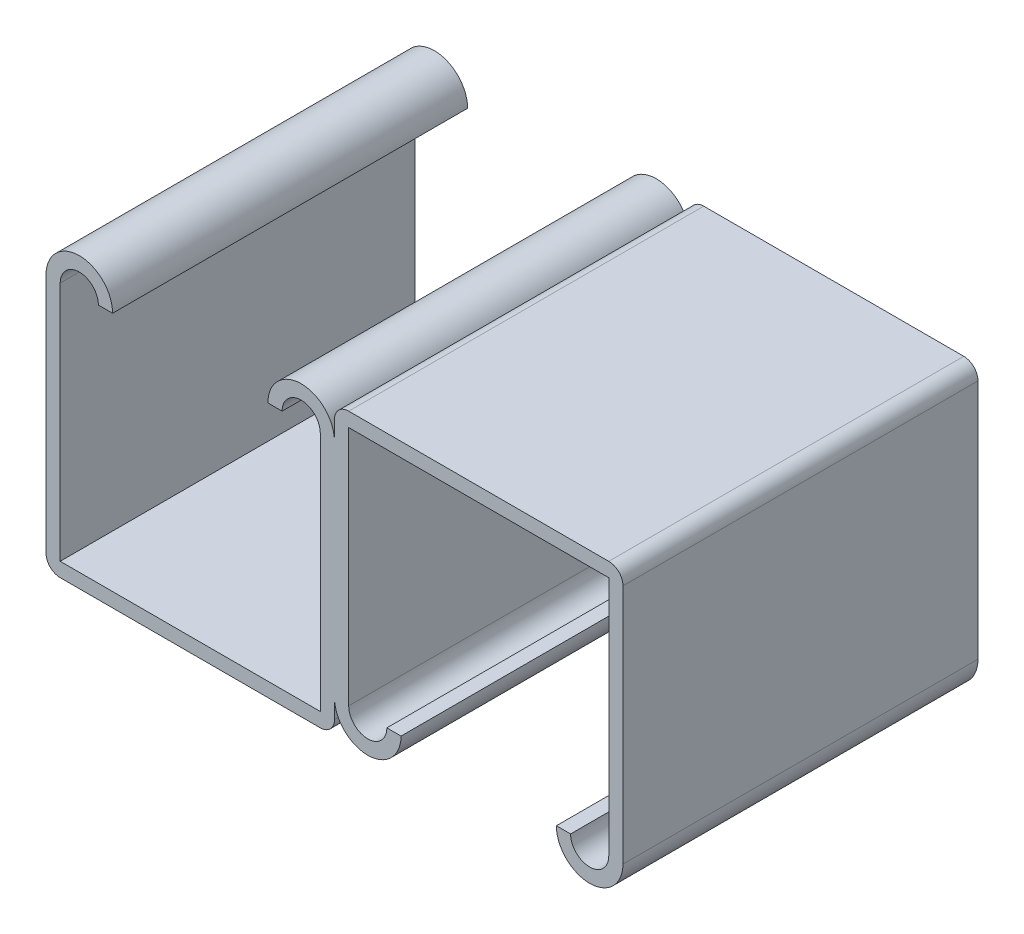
ISO-10303-21;
HEADER;
FILE_DESCRIPTION(('STEP AP214'),'2;1');
FILE_NAME('part.step','',(''),(''),'','','');
FILE_SCHEMA(('AUTOMOTIVE_DESIGN { 1 0 10303 214 1 1 1 1 }'));
ENDSEC;
DATA;
#1=APPLICATION_CONTEXT('core data for automotive mechanical design processes');
#2=APPLICATION_PROTOCOL_DEFINITION('international standard','automotive_design',2000,#1);
#3=PRODUCT_CONTEXT('',#1,'mechanical');
#4=PRODUCT('Part','Part','',(#3));
#5=PRODUCT_RELATED_PRODUCT_CATEGORY('part','',(#4));
#6=PRODUCT_DEFINITION_FORMATION('','',#4);
#7=PRODUCT_DEFINITION_CONTEXT('part definition',#1,'design');
#8=PRODUCT_DEFINITION('design','',#6,#7);
#9=PRODUCT_DEFINITION_SHAPE('','',#8);
#10=(LENGTH_UNIT() NAMED_UNIT(*) SI_UNIT(.MILLI.,.METRE.));
#11=(NAMED_UNIT(*) PLANE_ANGLE_UNIT() SI_UNIT($,.RADIAN.));
#12=(NAMED_UNIT(*) SI_UNIT($,.STERADIAN.) SOLID_ANGLE_UNIT());
#13=UNCERTAINTY_MEASURE_WITH_UNIT(LENGTH_MEASURE(1.E-05),#10,'distance_accuracy_value','');
#14=(GEOMETRIC_REPRESENTATION_CONTEXT(3) GLOBAL_UNCERTAINTY_ASSIGNED_CONTEXT((#13)) GLOBAL_UNIT_ASSIGNED_CONTEXT((#10,
#11,#12)) REPRESENTATION_CONTEXT('',''));
#15=CARTESIAN_POINT('',(0.,0.,0.));
#16=DIRECTION('',(0.,0.,1.));
#17=DIRECTION('',(1.,0.,0.));
#18=AXIS2_PLACEMENT_3D('',#15,#16,#17);
#19=CARTESIAN_POINT('',(-18.25625,7.9375,12.7));
#20=DIRECTION('',(0.,0.,-1.));
#21=DIRECTION('',(-1.,0.,0.));
#22=AXIS2_PLACEMENT_3D('',#19,#20,#21);
#23=CYLINDRICAL_SURFACE('',#22,2.38125);
#24=CARTESIAN_POINT('',(-18.25625,7.9375,-12.7));
#25=DIRECTION('',(0.,0.,1.));
#26=DIRECTION('',(-1.,0.,0.));
#27=AXIS2_PLACEMENT_3D('',#24,#25,#26);
#28=CIRCLE('',#27,2.38125);
#29=CARTESIAN_POINT('',(-15.875,7.9375,-12.7));
#30=VERTEX_POINT('',#29);
#31=CARTESIAN_POINT('',(-20.6375,7.9375,-12.7));
#32=VERTEX_POINT('',#31);
#33=EDGE_CURVE('E253',#30,#32,#28,.T.);
#34=ORIENTED_EDGE('',*,*,#33,.T.);
#35=DIRECTION('',(0.,0.,-1.));
#36=VECTOR('',#35,1.);
#37=CARTESIAN_POINT('',(-20.6375,7.9375,12.7));
#38=LINE('',#37,#36);
#39=CARTESIAN_POINT('',(-20.6375,7.9375,12.7));
#40=VERTEX_POINT('',#39);
#41=EDGE_CURVE('E11',#40,#32,#38,.T.);
#42=ORIENTED_EDGE('',*,*,#41,.F.);
#43=CARTESIAN_POINT('',(-18.25625,7.9375,12.7));
#44=DIRECTION('',(0.,0.,1.));
#45=DIRECTION('',(-1.,0.,0.));
#46=AXIS2_PLACEMENT_3D('',#43,#44,#45);
#47=CIRCLE('',#46,2.38125);
#48=CARTESIAN_POINT('',(-15.875,7.9375,12.7));
#49=VERTEX_POINT('',#48);
#50=EDGE_CURVE('E266',#49,#40,#47,.T.);
#51=ORIENTED_EDGE('',*,*,#50,.F.);
#52=DIRECTION('',(0.,0.,-1.));
#53=VECTOR('',#52,1.);
#54=CARTESIAN_POINT('',(-15.875,7.9375,12.7));
#55=LINE('',#54,#53);
#56=EDGE_CURVE('E311',#49,#30,#55,.T.);
#57=ORIENTED_EDGE('',*,*,#56,.T.);
#58=EDGE_LOOP('',(#34,#42,#51,#57));
#59=FACE_BOUND('',#58,.T.);
#60=ADVANCED_FACE('F41',(#59),#23,.T.);
#61=CARTESIAN_POINT('',(-20.6375,7.9375,12.7));
#62=DIRECTION('',(1.,0.,0.));
#63=DIRECTION('',(0.,1.,0.));
#64=AXIS2_PLACEMENT_3D('',#61,#62,#63);
#65=PLANE('',#64);
#66=DIRECTION('',(0.,-1.,0.));
#67=VECTOR('',#66,1.);
#68=CARTESIAN_POINT('',(-20.6375,7.9375,-12.7));
#69=LINE('',#68,#67);
#70=CARTESIAN_POINT('',(-20.6375,-9.30275,-12.7));
#71=VERTEX_POINT('',#70);
#72=EDGE_CURVE('E265',#32,#71,#69,.T.);
#73=ORIENTED_EDGE('',*,*,#72,.T.);
#74=DIRECTION('',(0.,0.,-1.));
#75=VECTOR('',#74,1.);
#76=CARTESIAN_POINT('',(-20.6375,-9.30275,12.7));
#77=LINE('',#76,#75);
#78=CARTESIAN_POINT('',(-20.6375,-9.30275,12.7));
#79=VERTEX_POINT('',#78);
#80=EDGE_CURVE('E47',#79,#71,#77,.T.);
#81=ORIENTED_EDGE('',*,*,#80,.F.);
#82=DIRECTION('',(0.,-1.,0.));
#83=VECTOR('',#82,1.);
#84=CARTESIAN_POINT('',(-20.6375,7.9375,12.7));
#85=LINE('',#84,#83);
#86=EDGE_CURVE('E275',#40,#79,#85,.T.);
#87=ORIENTED_EDGE('',*,*,#86,.F.);
#88=ORIENTED_EDGE('',*,*,#41,.T.);
#89=EDGE_LOOP('',(#73,#81,#87,#88));
#90=FACE_BOUND('',#89,.T.);
#91=ADVANCED_FACE('F418',(#90),#65,.F.);
#92=CARTESIAN_POINT('',(-19.6215,-9.30275,12.7));
#93=DIRECTION('',(0.,0.,-1.));
#94=DIRECTION('',(-1.,0.,0.));
#95=AXIS2_PLACEMENT_3D('',#92,#93,#94);
#96=CYLINDRICAL_SURFACE('',#95,1.016);
#97=CARTESIAN_POINT('',(-19.6215,-9.30275,-12.7));
#98=DIRECTION('',(0.,0.,1.));
#99=DIRECTION('',(-1.,0.,0.));
#100=AXIS2_PLACEMENT_3D('',#97,#98,#99);
#101=CIRCLE('',#100,1.016);
#102=CARTESIAN_POINT('',(-19.6215,-10.31875,-12.7));
#103=VERTEX_POINT('',#102);
#104=EDGE_CURVE('E314',#71,#103,#101,.T.);
#105=ORIENTED_EDGE('',*,*,#104,.T.);
#106=DIRECTION('',(0.,0.,-1.));
#107=VECTOR('',#106,1.);
#108=CARTESIAN_POINT('',(-19.6215,-10.31875,12.7));
#109=LINE('',#108,#107);
#110=CARTESIAN_POINT('',(-19.6215,-10.31875,12.7));
#111=VERTEX_POINT('',#110);
#112=EDGE_CURVE('E392',#111,#103,#109,.T.);
#113=ORIENTED_EDGE('',*,*,#112,.F.);
#114=CARTESIAN_POINT('',(-19.6215,-9.30275,12.7));
#115=DIRECTION('',(0.,0.,1.));
#116=DIRECTION('',(-1.,0.,0.));
#117=AXIS2_PLACEMENT_3D('',#114,#115,#116);
#118=CIRCLE('',#117,1.016);
#119=EDGE_CURVE('E279',#79,#111,#118,.T.);
#120=ORIENTED_EDGE('',*,*,#119,.F.);
#121=ORIENTED_EDGE('',*,*,#80,.T.);
#122=EDGE_LOOP('',(#105,#113,#120,#121));
#123=FACE_BOUND('',#122,.T.);
#124=ADVANCED_FACE('F402',(#123),#96,.T.);
#125=CARTESIAN_POINT('',(-19.6215,-10.31875,12.7));
#126=DIRECTION('',(0.,1.,0.));
#127=DIRECTION('',(-1.,0.,0.));
#128=AXIS2_PLACEMENT_3D('',#125,#126,#127);
#129=PLANE('',#128);
#130=DIRECTION('',(1.,0.,0.));
#131=VECTOR('',#130,1.);
#132=CARTESIAN_POINT('',(-19.6215,-10.31875,-12.7));
#133=LINE('',#132,#131);
#134=CARTESIAN_POINT('',(-1.016,-10.31875,-12.7));
#135=VERTEX_POINT('',#134);
#136=EDGE_CURVE('E319',#103,#135,#133,.T.);
#137=ORIENTED_EDGE('',*,*,#136,.T.);
#138=DIRECTION('',(0.,0.,-1.));
#139=VECTOR('',#138,1.);
#140=CARTESIAN_POINT('',(-1.016,-10.31875,12.7));
#141=LINE('',#140,#139);
#142=CARTESIAN_POINT('',(-1.016,-10.31875,12.7));
#143=VERTEX_POINT('',#142);
#144=EDGE_CURVE('E386',#143,#135,#141,.T.);
#145=ORIENTED_EDGE('',*,*,#144,.F.);
#146=DIRECTION('',(1.,0.,0.));
#147=VECTOR('',#146,1.);
#148=CARTESIAN_POINT('',(-19.6215,-10.31875,12.7));
#149=LINE('',#148,#147);
#150=EDGE_CURVE('E278',#111,#143,#149,.T.);
#151=ORIENTED_EDGE('',*,*,#150,.F.);
#152=ORIENTED_EDGE('',*,*,#112,.T.);
#153=EDGE_LOOP('',(#137,#145,#151,#152));
#154=FACE_BOUND('',#153,.T.);
#155=ADVANCED_FACE('F412',(#154),#129,.F.);
#156=CARTESIAN_POINT('',(-1.016,-9.30275,12.7));
#157=DIRECTION('',(0.,0.,-1.));
#158=DIRECTION('',(-1.,0.,0.));
#159=AXIS2_PLACEMENT_3D('',#156,#157,#158);
#160=CYLINDRICAL_SURFACE('',#159,1.016);
#161=CARTESIAN_POINT('',(-1.016,-9.30275,-12.7));
#162=DIRECTION('',(0.,0.,1.));
#163=DIRECTION('',(1.,0.,0.));
#164=AXIS2_PLACEMENT_3D('',#161,#162,#163);
#165=CIRCLE('',#164,1.016);
#166=CARTESIAN_POINT('',(0.,-9.30275,-12.7));
#167=VERTEX_POINT('',#166);
#168=EDGE_CURVE('E324',#135,#167,#165,.T.);
#169=ORIENTED_EDGE('',*,*,#168,.T.);
#170=DIRECTION('',(0.,0.,-1.));
#171=VECTOR('',#170,1.);
#172=CARTESIAN_POINT('',(0.,-9.30275,12.7));
#173=LINE('',#172,#171);
#174=CARTESIAN_POINT('',(0.,-9.30275,12.7));
#175=VERTEX_POINT('',#174);
#176=EDGE_CURVE('E381',#175,#167,#173,.T.);
#177=ORIENTED_EDGE('',*,*,#176,.F.);
#178=CARTESIAN_POINT('',(-1.016,-9.30275,12.7));
#179=DIRECTION('',(0.,0.,1.));
#180=DIRECTION('',(1.,0.,0.));
#181=AXIS2_PLACEMENT_3D('',#178,#179,#180);
#182=CIRCLE('',#181,1.016);
#183=EDGE_CURVE('E285',#143,#175,#182,.T.);
#184=ORIENTED_EDGE('',*,*,#183,.F.);
#185=ORIENTED_EDGE('',*,*,#144,.T.);
#186=EDGE_LOOP('',(#169,#177,#184,#185));
#187=FACE_BOUND('',#186,.T.);
#188=ADVANCED_FACE('F411',(#187),#160,.T.);
#189=CARTESIAN_POINT('',(0.,-9.30275,12.7));
#190=DIRECTION('',(-1.,0.,0.));
#191=DIRECTION('',(0.,0.,1.));
#192=AXIS2_PLACEMENT_3D('',#189,#190,#191);
#193=PLANE('',#192);
#194=DIRECTION('',(0.,1.,0.));
#195=VECTOR('',#194,1.);
#196=CARTESIAN_POINT('',(0.,-9.30275,-12.7));
#197=LINE('',#196,#195);
#198=CARTESIAN_POINT('',(0.,-7.93749999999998,-12.7));
#199=VERTEX_POINT('',#198);
#200=EDGE_CURVE('E64',#167,#199,#197,.T.);
#201=ORIENTED_EDGE('',*,*,#200,.T.);
#202=DIRECTION('',(0.,0.,-1.));
#203=VECTOR('',#202,1.);
#204=CARTESIAN_POINT('',(0.,-7.9375,12.7));
#205=LINE('',#204,#203);
#206=CARTESIAN_POINT('',(0.,-7.93749999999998,12.7));
#207=VERTEX_POINT('',#206);
#208=EDGE_CURVE('E57',#207,#199,#205,.T.);
#209=ORIENTED_EDGE('',*,*,#208,.F.);
#210=DIRECTION('',(0.,1.,0.));
#211=VECTOR('',#210,1.);
#212=CARTESIAN_POINT('',(0.,-9.30275,12.7));
#213=LINE('',#212,#211);
#214=EDGE_CURVE('E281',#175,#207,#213,.T.);
#215=ORIENTED_EDGE('',*,*,#214,.F.);
#216=ORIENTED_EDGE('',*,*,#176,.T.);
#217=EDGE_LOOP('',(#201,#209,#215,#216));
#218=FACE_BOUND('',#217,.T.);
#219=ADVANCED_FACE('F620',(#218),#193,.F.);
#220=CARTESIAN_POINT('',(-2.38125,7.9375,12.7));
#221=DIRECTION('',(0.,0.,-1.));
#222=DIRECTION('',(-1.,0.,0.));
#223=AXIS2_PLACEMENT_3D('',#220,#221,#222);
#224=CYLINDRICAL_SURFACE('',#223,2.38125);
#225=CARTESIAN_POINT('',(-2.38125,7.9375,-12.7));
#226=DIRECTION('',(0.,0.,1.));
#227=DIRECTION('',(1.,0.,0.));
#228=AXIS2_PLACEMENT_3D('',#225,#226,#227);
#229=CIRCLE('',#228,2.38125);
#230=CARTESIAN_POINT('',(0.,7.93750000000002,-12.7));
#231=VERTEX_POINT('',#230);
#232=CARTESIAN_POINT('',(-4.7625,7.9375,-12.7));
#233=VERTEX_POINT('',#232);
#234=EDGE_CURVE('E327',#231,#233,#229,.T.);
#235=ORIENTED_EDGE('',*,*,#234,.T.);
#236=DIRECTION('',(0.,0.,-1.));
#237=VECTOR('',#236,1.);
#238=CARTESIAN_POINT('',(-4.7625,7.9375,12.7));
#239=LINE('',#238,#237);
#240=CARTESIAN_POINT('',(-4.7625,7.9375,12.7));
#241=VERTEX_POINT('',#240);
#242=EDGE_CURVE('E376',#241,#233,#239,.T.);
#243=ORIENTED_EDGE('',*,*,#242,.F.);
#244=CARTESIAN_POINT('',(-2.38125,7.9375,12.7));
#245=DIRECTION('',(0.,0.,1.));
#246=DIRECTION('',(1.,0.,0.));
#247=AXIS2_PLACEMENT_3D('',#244,#245,#246);
#248=CIRCLE('',#247,2.38125);
#249=CARTESIAN_POINT('',(0.,7.9375,12.7));
#250=VERTEX_POINT('',#249);
#251=EDGE_CURVE('E289',#250,#241,#248,.T.);
#252=ORIENTED_EDGE('',*,*,#251,.F.);
#253=DIRECTION('',(0.,0.,-1.));
#254=VECTOR('',#253,1.);
#255=CARTESIAN_POINT('',(0.,7.9375,12.7));
#256=LINE('',#255,#254);
#257=EDGE_CURVE('E379',#250,#231,#256,.T.);
#258=ORIENTED_EDGE('',*,*,#257,.T.);
#259=EDGE_LOOP('',(#235,#243,#252,#258));
#260=FACE_BOUND('',#259,.T.);
#261=ADVANCED_FACE('F456',(#260),#224,.T.);
#262=CARTESIAN_POINT('',(-4.7625,7.9375,12.7));
#263=DIRECTION('',(0.,1.,0.));
#264=DIRECTION('',(0.,0.,1.));
#265=AXIS2_PLACEMENT_3D('',#262,#263,#264);
#266=PLANE('',#265);
#267=DIRECTION('',(1.,0.,0.));
#268=VECTOR('',#267,1.);
#269=CARTESIAN_POINT('',(-4.7625,7.9375,-12.7));
#270=LINE('',#269,#268);
#271=CARTESIAN_POINT('',(-3.7465,7.9375,-12.7));
#272=VERTEX_POINT('',#271);
#273=EDGE_CURVE('E329',#233,#272,#270,.T.);
#274=ORIENTED_EDGE('',*,*,#273,.T.);
#275=DIRECTION('',(0.,0.,-1.));
#276=VECTOR('',#275,1.);
#277=CARTESIAN_POINT('',(-3.7465,7.9375,12.7));
#278=LINE('',#277,#276);
#279=CARTESIAN_POINT('',(-3.7465,7.9375,12.7));
#280=VERTEX_POINT('',#279);
#281=EDGE_CURVE('E375',#280,#272,#278,.T.);
#282=ORIENTED_EDGE('',*,*,#281,.F.);
#283=DIRECTION('',(1.,0.,0.));
#284=VECTOR('',#283,1.);
#285=CARTESIAN_POINT('',(-4.7625,7.9375,12.7));
#286=LINE('',#285,#284);
#287=EDGE_CURVE('E293',#241,#280,#286,.T.);
#288=ORIENTED_EDGE('',*,*,#287,.F.);
#289=ORIENTED_EDGE('',*,*,#242,.T.);
#290=EDGE_LOOP('',(#274,#282,#288,#289));
#291=FACE_BOUND('',#290,.T.);
#292=ADVANCED_FACE('F457',(#291),#266,.F.);
#293=CARTESIAN_POINT('',(-2.38125,7.9375,12.7));
#294=DIRECTION('',(0.,0.,-1.));
#295=DIRECTION('',(-1.,0.,0.));
#296=AXIS2_PLACEMENT_3D('',#293,#294,#295);
#297=CYLINDRICAL_SURFACE('',#296,1.36525);
#298=CARTESIAN_POINT('',(-2.38125,7.9375,-12.7));
#299=DIRECTION('',(0.,0.,-1.));
#300=DIRECTION('',(1.,0.,0.));
#301=AXIS2_PLACEMENT_3D('',#298,#299,#300);
#302=CIRCLE('',#301,1.36525);
#303=CARTESIAN_POINT('',(-1.016,7.9375,-12.7));
#304=VERTEX_POINT('',#303);
#305=EDGE_CURVE('E335',#272,#304,#302,.T.);
#306=ORIENTED_EDGE('',*,*,#305,.T.);
#307=DIRECTION('',(0.,0.,-1.));
#308=VECTOR('',#307,1.);
#309=CARTESIAN_POINT('',(-1.016,7.9375,12.7));
#310=LINE('',#309,#308);
#311=CARTESIAN_POINT('',(-1.016,7.9375,12.7));
#312=VERTEX_POINT('',#311);
#313=EDGE_CURVE('E368',#312,#304,#310,.T.);
#314=ORIENTED_EDGE('',*,*,#313,.F.);
#315=CARTESIAN_POINT('',(-2.38125,7.9375,12.7));
#316=DIRECTION('',(0.,0.,-1.));
#317=DIRECTION('',(1.,0.,0.));
#318=AXIS2_PLACEMENT_3D('',#315,#316,#317);
#319=CIRCLE('',#318,1.36525);
#320=EDGE_CURVE('E295',#280,#312,#319,.T.);
#321=ORIENTED_EDGE('',*,*,#320,.F.);
#322=ORIENTED_EDGE('',*,*,#281,.T.);
#323=EDGE_LOOP('',(#306,#314,#321,#322));
#324=FACE_BOUND('',#323,.T.);
#325=ADVANCED_FACE('F454',(#324),#297,.F.);
#326=CARTESIAN_POINT('',(-1.016,-9.30275,12.7));
#327=DIRECTION('',(1.,0.,0.));
#328=DIRECTION('',(0.,0.,-1.));
#329=AXIS2_PLACEMENT_3D('',#326,#327,#328);
#330=PLANE('',#329);
#331=DIRECTION('',(0.,-1.,0.));
#332=VECTOR('',#331,1.);
#333=CARTESIAN_POINT('',(-1.016,-9.30275,-12.7));
#334=LINE('',#333,#332);
#335=CARTESIAN_POINT('',(-1.016,-9.30275,-12.7));
#336=VERTEX_POINT('',#335);
#337=EDGE_CURVE('E333',#304,#336,#334,.T.);
#338=ORIENTED_EDGE('',*,*,#337,.T.);
#339=DIRECTION('',(0.,0.,-1.));
#340=VECTOR('',#339,1.);
#341=CARTESIAN_POINT('',(-1.016,-9.30275,12.7));
#342=LINE('',#341,#340);
#343=CARTESIAN_POINT('',(-1.016,-9.30275,12.7));
#344=VERTEX_POINT('',#343);
#345=EDGE_CURVE('E364',#344,#336,#342,.T.);
#346=ORIENTED_EDGE('',*,*,#345,.F.);
#347=DIRECTION('',(0.,-1.,0.));
#348=VECTOR('',#347,1.);
#349=CARTESIAN_POINT('',(-1.016,-9.30275,12.7));
#350=LINE('',#349,#348);
#351=EDGE_CURVE('E300',#312,#344,#350,.T.);
#352=ORIENTED_EDGE('',*,*,#351,.F.);
#353=ORIENTED_EDGE('',*,*,#313,.T.);
#354=EDGE_LOOP('',(#338,#346,#352,#353));
#355=FACE_BOUND('',#354,.T.);
#356=ADVANCED_FACE('F450',(#355),#330,.F.);
#357=CARTESIAN_POINT('',(-19.6215,-9.30275,12.7));
#358=DIRECTION('',(0.,-1.,0.));
#359=DIRECTION('',(0.,0.,-1.));
#360=AXIS2_PLACEMENT_3D('',#357,#358,#359);
#361=PLANE('',#360);
#362=DIRECTION('',(-1.,0.,0.));
#363=VECTOR('',#362,1.);
#364=CARTESIAN_POINT('',(-19.6215,-9.30275,-12.7));
#365=LINE('',#364,#363);
#366=CARTESIAN_POINT('',(-19.6215,-9.30275,-12.7));
#367=VERTEX_POINT('',#366);
#368=EDGE_CURVE('E336',#336,#367,#365,.T.);
#369=ORIENTED_EDGE('',*,*,#368,.T.);
#370=DIRECTION('',(0.,0.,-1.));
#371=VECTOR('',#370,1.);
#372=CARTESIAN_POINT('',(-19.6215,-9.30275,12.7));
#373=LINE('',#372,#371);
#374=CARTESIAN_POINT('',(-19.6215,-9.30275,12.7));
#375=VERTEX_POINT('',#374);
#376=EDGE_CURVE('E359',#375,#367,#373,.T.);
#377=ORIENTED_EDGE('',*,*,#376,.F.);
#378=DIRECTION('',(-1.,0.,0.));
#379=VECTOR('',#378,1.);
#380=CARTESIAN_POINT('',(-19.6215,-9.30275,12.7));
#381=LINE('',#380,#379);
#382=EDGE_CURVE('E297',#344,#375,#381,.T.);
#383=ORIENTED_EDGE('',*,*,#382,.F.);
#384=ORIENTED_EDGE('',*,*,#345,.T.);
#385=EDGE_LOOP('',(#369,#377,#383,#384));
#386=FACE_BOUND('',#385,.T.);
#387=ADVANCED_FACE('F445',(#386),#361,.F.);
#388=CARTESIAN_POINT('',(-19.6215,7.9375,12.7));
#389=DIRECTION('',(-1.,0.,0.));
#390=DIRECTION('',(0.,0.,1.));
#391=AXIS2_PLACEMENT_3D('',#388,#389,#390);
#392=PLANE('',#391);
#393=DIRECTION('',(0.,1.,0.));
#394=VECTOR('',#393,1.);
#395=CARTESIAN_POINT('',(-19.6215,7.9375,-12.7));
#396=LINE('',#395,#394);
#397=CARTESIAN_POINT('',(-19.6215,7.9375,-12.7));
#398=VERTEX_POINT('',#397);
#399=EDGE_CURVE('E344',#367,#398,#396,.T.);
#400=ORIENTED_EDGE('',*,*,#399,.T.);
#401=DIRECTION('',(0.,0.,-1.));
#402=VECTOR('',#401,1.);
#403=CARTESIAN_POINT('',(-19.6215,7.9375,12.7));
#404=LINE('',#403,#402);
#405=CARTESIAN_POINT('',(-19.6215,7.9375,12.7));
#406=VERTEX_POINT('',#405);
#407=EDGE_CURVE('E358',#406,#398,#404,.T.);
#408=ORIENTED_EDGE('',*,*,#407,.F.);
#409=DIRECTION('',(0.,1.,0.));
#410=VECTOR('',#409,1.);
#411=CARTESIAN_POINT('',(-19.6215,7.9375,12.7));
#412=LINE('',#411,#410);
#413=EDGE_CURVE('E303',#375,#406,#412,.T.);
#414=ORIENTED_EDGE('',*,*,#413,.F.);
#415=ORIENTED_EDGE('',*,*,#376,.T.);
#416=EDGE_LOOP('',(#400,#408,#414,#415));
#417=FACE_BOUND('',#416,.T.);
#418=ADVANCED_FACE('F436',(#417),#392,.F.);
#419=CARTESIAN_POINT('',(-18.25625,7.9375,12.7));
#420=DIRECTION('',(0.,0.,-1.));
#421=DIRECTION('',(-1.,0.,0.));
#422=AXIS2_PLACEMENT_3D('',#419,#420,#421);
#423=CYLINDRICAL_SURFACE('',#422,1.36525);
#424=CARTESIAN_POINT('',(-18.25625,7.9375,-12.7));
#425=DIRECTION('',(0.,0.,-1.));
#426=DIRECTION('',(-1.,0.,0.));
#427=AXIS2_PLACEMENT_3D('',#424,#425,#426);
#428=CIRCLE('',#427,1.36525);
#429=CARTESIAN_POINT('',(-16.891,7.9375,-12.7));
#430=VERTEX_POINT('',#429);
#431=EDGE_CURVE('E343',#398,#430,#428,.T.);
#432=ORIENTED_EDGE('',*,*,#431,.T.);
#433=DIRECTION('',(0.,0.,-1.));
#434=VECTOR('',#433,1.);
#435=CARTESIAN_POINT('',(-16.891,7.9375,12.7));
#436=LINE('',#435,#434);
#437=CARTESIAN_POINT('',(-16.891,7.9375,12.7));
#438=VERTEX_POINT('',#437);
#439=EDGE_CURVE('E355',#438,#430,#436,.T.);
#440=ORIENTED_EDGE('',*,*,#439,.F.);
#441=CARTESIAN_POINT('',(-18.25625,7.9375,12.7));
#442=DIRECTION('',(0.,0.,-1.));
#443=DIRECTION('',(-1.,0.,0.));
#444=AXIS2_PLACEMENT_3D('',#441,#442,#443);
#445=CIRCLE('',#444,1.36525);
#446=EDGE_CURVE('E306',#406,#438,#445,.T.);
#447=ORIENTED_EDGE('',*,*,#446,.F.);
#448=ORIENTED_EDGE('',*,*,#407,.T.);
#449=EDGE_LOOP('',(#432,#440,#447,#448));
#450=FACE_BOUND('',#449,.T.);
#451=ADVANCED_FACE('F435',(#450),#423,.F.);
#452=CARTESIAN_POINT('',(-16.891,7.9375,12.7));
#453=DIRECTION('',(0.,1.,0.));
#454=DIRECTION('',(0.,0.,1.));
#455=AXIS2_PLACEMENT_3D('',#452,#453,#454);
#456=PLANE('',#455);
#457=DIRECTION('',(1.,0.,0.));
#458=VECTOR('',#457,1.);
#459=CARTESIAN_POINT('',(-16.891,7.9375,-12.7));
#460=LINE('',#459,#458);
#461=EDGE_CURVE('E271',#430,#30,#460,.T.);
#462=ORIENTED_EDGE('',*,*,#461,.T.);
#463=ORIENTED_EDGE('',*,*,#56,.F.);
#464=DIRECTION('',(1.,0.,0.));
#465=VECTOR('',#464,1.);
#466=CARTESIAN_POINT('',(-16.891,7.9375,12.7));
#467=LINE('',#466,#465);
#468=EDGE_CURVE('E307',#438,#49,#467,.T.);
#469=ORIENTED_EDGE('',*,*,#468,.F.);
#470=ORIENTED_EDGE('',*,*,#439,.T.);
#471=EDGE_LOOP('',(#462,#463,#469,#470));
#472=FACE_BOUND('',#471,.T.);
#473=ADVANCED_FACE('F430',(#472),#456,.F.);
#474=CARTESIAN_POINT('',(-18.25625,7.9375,12.7));
#475=DIRECTION('',(0.,0.,-1.));
#476=DIRECTION('',(-1.,0.,0.));
#477=AXIS2_PLACEMENT_3D('',#474,#475,#476);
#478=PLANE('',#477);
#479=ORIENTED_EDGE('',*,*,#50,.T.);
#480=ORIENTED_EDGE('',*,*,#86,.T.);
#481=ORIENTED_EDGE('',*,*,#119,.T.);
#482=ORIENTED_EDGE('',*,*,#150,.T.);
#483=ORIENTED_EDGE('',*,*,#183,.T.);
#484=ORIENTED_EDGE('',*,*,#214,.T.);
#485=CARTESIAN_POINT('',(2.38125000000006,-7.93749999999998,12.7));
#486=DIRECTION('',(0.,0.,1.));
#487=DIRECTION('',(-1.,0.,0.));
#488=AXIS2_PLACEMENT_3D('',#485,#486,#487);
#489=CIRCLE('',#488,2.38125);
#490=CARTESIAN_POINT('',(4.76250000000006,-7.93749999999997,12.7));
#491=VERTEX_POINT('',#490);
#492=EDGE_CURVE('E583',#207,#491,#489,.T.);
#493=ORIENTED_EDGE('',*,*,#492,.T.);
#494=DIRECTION('',(-1.,0.,0.));
#495=VECTOR('',#494,1.);
#496=CARTESIAN_POINT('',(4.76250000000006,-7.93749999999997,12.7));
#497=LINE('',#496,#495);
#498=CARTESIAN_POINT('',(3.74650000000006,-7.93749999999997,12.7));
#499=VERTEX_POINT('',#498);
#500=EDGE_CURVE('E584',#491,#499,#497,.T.);
#501=ORIENTED_EDGE('',*,*,#500,.T.);
#502=CARTESIAN_POINT('',(2.38125000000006,-7.93749999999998,12.7));
#503=DIRECTION('',(0.,0.,-1.));
#504=DIRECTION('',(-1.,0.,0.));
#505=AXIS2_PLACEMENT_3D('',#502,#503,#504);
#506=CIRCLE('',#505,1.36525);
#507=CARTESIAN_POINT('',(1.01600000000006,-7.93749999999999,12.7));
#508=VERTEX_POINT('',#507);
#509=EDGE_CURVE('E579',#499,#508,#506,.T.);
#510=ORIENTED_EDGE('',*,*,#509,.T.);
#511=DIRECTION('',(0.,1.,0.));
#512=VECTOR('',#511,1.);
#513=CARTESIAN_POINT('',(1.01599999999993,9.30275000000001,12.7));
#514=LINE('',#513,#512);
#515=CARTESIAN_POINT('',(1.01599999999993,9.30275000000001,12.7));
#516=VERTEX_POINT('',#515);
#517=EDGE_CURVE('E574',#508,#516,#514,.T.);
#518=ORIENTED_EDGE('',*,*,#517,.T.);
#519=DIRECTION('',(1.,0.,0.));
#520=VECTOR('',#519,1.);
#521=CARTESIAN_POINT('',(19.6214999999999,9.30275000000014,12.7));
#522=LINE('',#521,#520);
#523=CARTESIAN_POINT('',(19.6214999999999,9.30275000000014,12.7));
#524=VERTEX_POINT('',#523);
#525=EDGE_CURVE('E575',#516,#524,#522,.T.);
#526=ORIENTED_EDGE('',*,*,#525,.T.);
#527=DIRECTION('',(0.,-1.,0.));
#528=VECTOR('',#527,1.);
#529=CARTESIAN_POINT('',(19.6215000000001,-7.93749999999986,12.7));
#530=LINE('',#529,#528);
#531=CARTESIAN_POINT('',(19.6215000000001,-7.93749999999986,12.7));
#532=VERTEX_POINT('',#531);
#533=EDGE_CURVE('E567',#524,#532,#530,.T.);
#534=ORIENTED_EDGE('',*,*,#533,.T.);
#535=CARTESIAN_POINT('',(18.2562500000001,-7.93749999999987,12.7));
#536=DIRECTION('',(0.,0.,-1.));
#537=DIRECTION('',(1.,0.,0.));
#538=AXIS2_PLACEMENT_3D('',#535,#536,#537);
#539=CIRCLE('',#538,1.36525);
#540=CARTESIAN_POINT('',(16.8910000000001,-7.93749999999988,12.7));
#541=VERTEX_POINT('',#540);
#542=EDGE_CURVE('E566',#532,#541,#539,.T.);
#543=ORIENTED_EDGE('',*,*,#542,.T.);
#544=DIRECTION('',(-1.,0.,0.));
#545=VECTOR('',#544,1.);
#546=CARTESIAN_POINT('',(16.8910000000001,-7.93749999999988,12.7));
#547=LINE('',#546,#545);
#548=CARTESIAN_POINT('',(15.8750000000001,-7.93749999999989,12.7));
#549=VERTEX_POINT('',#548);
#550=EDGE_CURVE('E242',#541,#549,#547,.T.);
#551=ORIENTED_EDGE('',*,*,#550,.T.);
#552=CARTESIAN_POINT('',(18.2562500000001,-7.93749999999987,12.7));
#553=DIRECTION('',(0.,0.,1.));
#554=DIRECTION('',(1.,0.,0.));
#555=AXIS2_PLACEMENT_3D('',#552,#553,#554);
#556=CIRCLE('',#555,2.38125);
#557=CARTESIAN_POINT('',(20.6375000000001,-7.93749999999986,12.7));
#558=VERTEX_POINT('',#557);
#559=EDGE_CURVE('E238',#549,#558,#556,.T.);
#560=ORIENTED_EDGE('',*,*,#559,.T.);
#561=DIRECTION('',(0.,1.,0.));
#562=VECTOR('',#561,1.);
#563=CARTESIAN_POINT('',(20.6375000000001,-7.93749999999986,12.7));
#564=LINE('',#563,#562);
#565=CARTESIAN_POINT('',(20.6374999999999,9.30275000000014,12.7));
#566=VERTEX_POINT('',#565);
#567=EDGE_CURVE('E228',#558,#566,#564,.T.);
#568=ORIENTED_EDGE('',*,*,#567,.T.);
#569=CARTESIAN_POINT('',(19.6214999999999,9.30275000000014,12.7));
#570=DIRECTION('',(0.,0.,1.));
#571=DIRECTION('',(1.,0.,0.));
#572=AXIS2_PLACEMENT_3D('',#569,#570,#571);
#573=CIRCLE('',#572,1.016);
#574=CARTESIAN_POINT('',(19.6214999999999,10.3187500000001,12.7));
#575=VERTEX_POINT('',#574);
#576=EDGE_CURVE('E240',#566,#575,#573,.T.);
#577=ORIENTED_EDGE('',*,*,#576,.T.);
#578=DIRECTION('',(-1.,0.,0.));
#579=VECTOR('',#578,1.);
#580=CARTESIAN_POINT('',(19.6214999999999,10.3187500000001,12.7));
#581=LINE('',#580,#579);
#582=CARTESIAN_POINT('',(1.01599999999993,10.31875,12.7));
#583=VERTEX_POINT('',#582);
#584=EDGE_CURVE('E548',#575,#583,#581,.T.);
#585=ORIENTED_EDGE('',*,*,#584,.T.);
#586=CARTESIAN_POINT('',(1.01599999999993,9.30275000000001,12.7));
#587=DIRECTION('',(0.,0.,1.));
#588=DIRECTION('',(-1.,0.,0.));
#589=AXIS2_PLACEMENT_3D('',#586,#587,#588);
#590=CIRCLE('',#589,1.016);
#591=CARTESIAN_POINT('',(0.,9.30275,12.7));
#592=VERTEX_POINT('',#591);
#593=EDGE_CURVE('E589',#583,#592,#590,.T.);
#594=ORIENTED_EDGE('',*,*,#593,.T.);
#595=DIRECTION('',(0.,-1.,0.));
#596=VECTOR('',#595,1.);
#597=CARTESIAN_POINT('',(0.,9.30275,12.7));
#598=LINE('',#597,#596);
#599=EDGE_CURVE('E590',#592,#250,#598,.T.);
#600=ORIENTED_EDGE('',*,*,#599,.T.);
#601=ORIENTED_EDGE('',*,*,#251,.T.);
#602=ORIENTED_EDGE('',*,*,#287,.T.);
#603=ORIENTED_EDGE('',*,*,#320,.T.);
#604=ORIENTED_EDGE('',*,*,#351,.T.);
#605=ORIENTED_EDGE('',*,*,#382,.T.);
#606=ORIENTED_EDGE('',*,*,#413,.T.);
#607=ORIENTED_EDGE('',*,*,#446,.T.);
#608=ORIENTED_EDGE('',*,*,#468,.T.);
#609=EDGE_LOOP('',(#479,#480,#481,#482,#483,#484,#493,#501,#510,#518,#526,#534,#543,#551,#560,
#568,#577,#585,#594,#600,#601,#602,#603,#604,#605,#606,#607,#608));
#610=FACE_BOUND('',#609,.T.);
#611=ADVANCED_FACE('F245',(#610),#478,.F.);
#612=CARTESIAN_POINT('',(-18.25625,7.9375,-12.7));
#613=DIRECTION('',(0.,0.,-1.));
#614=DIRECTION('',(-1.,0.,0.));
#615=AXIS2_PLACEMENT_3D('',#612,#613,#614);
#616=PLANE('',#615);
#617=ORIENTED_EDGE('',*,*,#33,.F.);
#618=ORIENTED_EDGE('',*,*,#461,.F.);
#619=ORIENTED_EDGE('',*,*,#431,.F.);
#620=ORIENTED_EDGE('',*,*,#399,.F.);
#621=ORIENTED_EDGE('',*,*,#368,.F.);
#622=ORIENTED_EDGE('',*,*,#337,.F.);
#623=ORIENTED_EDGE('',*,*,#305,.F.);
#624=ORIENTED_EDGE('',*,*,#273,.F.);
#625=ORIENTED_EDGE('',*,*,#234,.F.);
#626=DIRECTION('',(0.,-1.,0.));
#627=VECTOR('',#626,1.);
#628=CARTESIAN_POINT('',(0.,9.30275,-12.7));
#629=LINE('',#628,#627);
#630=CARTESIAN_POINT('',(0.,9.30275,-12.7));
#631=VERTEX_POINT('',#630);
#632=EDGE_CURVE('E470',#631,#231,#629,.T.);
#633=ORIENTED_EDGE('',*,*,#632,.F.);
#634=CARTESIAN_POINT('',(1.01599999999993,9.30275000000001,-12.7));
#635=DIRECTION('',(0.,0.,1.));
#636=DIRECTION('',(-1.,0.,0.));
#637=AXIS2_PLACEMENT_3D('',#634,#635,#636);
#638=CIRCLE('',#637,1.016);
#639=CARTESIAN_POINT('',(1.01599999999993,10.31875,-12.7));
#640=VERTEX_POINT('',#639);
#641=EDGE_CURVE('E473',#640,#631,#638,.T.);
#642=ORIENTED_EDGE('',*,*,#641,.F.);
#643=DIRECTION('',(-1.,0.,0.));
#644=VECTOR('',#643,1.);
#645=CARTESIAN_POINT('',(19.6214999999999,10.3187500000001,-12.7));
#646=LINE('',#645,#644);
#647=CARTESIAN_POINT('',(19.6214999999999,10.3187500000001,-12.7));
#648=VERTEX_POINT('',#647);
#649=EDGE_CURVE('E482',#648,#640,#646,.T.);
#650=ORIENTED_EDGE('',*,*,#649,.F.);
#651=CARTESIAN_POINT('',(19.6214999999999,9.30275000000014,-12.7));
#652=DIRECTION('',(0.,0.,1.));
#653=DIRECTION('',(1.,0.,0.));
#654=AXIS2_PLACEMENT_3D('',#651,#652,#653);
#655=CIRCLE('',#654,1.016);
#656=CARTESIAN_POINT('',(20.6374999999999,9.30275000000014,-12.7));
#657=VERTEX_POINT('',#656);
#658=EDGE_CURVE('E551',#657,#648,#655,.T.);
#659=ORIENTED_EDGE('',*,*,#658,.F.);
#660=DIRECTION('',(0.,1.,0.));
#661=VECTOR('',#660,1.);
#662=CARTESIAN_POINT('',(20.6375000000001,-7.93749999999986,-12.7));
#663=LINE('',#662,#661);
#664=CARTESIAN_POINT('',(20.6375000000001,-7.93749999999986,-12.7));
#665=VERTEX_POINT('',#664);
#666=EDGE_CURVE('E560',#665,#657,#663,.T.);
#667=ORIENTED_EDGE('',*,*,#666,.F.);
#668=CARTESIAN_POINT('',(18.2562500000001,-7.93749999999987,-12.7));
#669=DIRECTION('',(0.,0.,1.));
#670=DIRECTION('',(1.,0.,0.));
#671=AXIS2_PLACEMENT_3D('',#668,#669,#670);
#672=CIRCLE('',#671,2.38125);
#673=CARTESIAN_POINT('',(15.8750000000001,-7.93749999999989,-12.7));
#674=VERTEX_POINT('',#673);
#675=EDGE_CURVE('E254',#674,#665,#672,.T.);
#676=ORIENTED_EDGE('',*,*,#675,.F.);
#677=DIRECTION('',(-1.,0.,0.));
#678=VECTOR('',#677,1.);
#679=CARTESIAN_POINT('',(16.8910000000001,-7.93749999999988,-12.7));
#680=LINE('',#679,#678);
#681=CARTESIAN_POINT('',(16.8910000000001,-7.93749999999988,-12.7));
#682=VERTEX_POINT('',#681);
#683=EDGE_CURVE('E248',#682,#674,#680,.T.);
#684=ORIENTED_EDGE('',*,*,#683,.F.);
#685=CARTESIAN_POINT('',(18.2562500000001,-7.93749999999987,-12.7));
#686=DIRECTION('',(0.,0.,-1.));
#687=DIRECTION('',(1.,0.,0.));
#688=AXIS2_PLACEMENT_3D('',#685,#686,#687);
#689=CIRCLE('',#688,1.36525);
#690=CARTESIAN_POINT('',(19.6215000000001,-7.93749999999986,-12.7));
#691=VERTEX_POINT('',#690);
#692=EDGE_CURVE('E497',#691,#682,#689,.T.);
#693=ORIENTED_EDGE('',*,*,#692,.F.);
#694=DIRECTION('',(0.,-1.,0.));
#695=VECTOR('',#694,1.);
#696=CARTESIAN_POINT('',(19.6215000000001,-7.93749999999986,-12.7));
#697=LINE('',#696,#695);
#698=CARTESIAN_POINT('',(19.6214999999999,9.30275000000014,-12.7));
#699=VERTEX_POINT('',#698);
#700=EDGE_CURVE('E496',#699,#691,#697,.T.);
#701=ORIENTED_EDGE('',*,*,#700,.F.);
#702=DIRECTION('',(1.,0.,0.));
#703=VECTOR('',#702,1.);
#704=CARTESIAN_POINT('',(19.6214999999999,9.30275000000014,-12.7));
#705=LINE('',#704,#703);
#706=CARTESIAN_POINT('',(1.01599999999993,9.30275000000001,-12.7));
#707=VERTEX_POINT('',#706);
#708=EDGE_CURVE('E491',#707,#699,#705,.T.);
#709=ORIENTED_EDGE('',*,*,#708,.F.);
#710=DIRECTION('',(0.,1.,0.));
#711=VECTOR('',#710,1.);
#712=CARTESIAN_POINT('',(1.01599999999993,9.30275000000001,-12.7));
#713=LINE('',#712,#711);
#714=CARTESIAN_POINT('',(1.01600000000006,-7.93749999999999,-12.7));
#715=VERTEX_POINT('',#714);
#716=EDGE_CURVE('E489',#715,#707,#713,.T.);
#717=ORIENTED_EDGE('',*,*,#716,.F.);
#718=CARTESIAN_POINT('',(2.38125000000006,-7.93749999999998,-12.7));
#719=DIRECTION('',(0.,0.,-1.));
#720=DIRECTION('',(-1.,0.,0.));
#721=AXIS2_PLACEMENT_3D('',#718,#719,#720);
#722=CIRCLE('',#721,1.36525);
#723=CARTESIAN_POINT('',(3.74650000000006,-7.93749999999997,-12.7));
#724=VERTEX_POINT('',#723);
#725=EDGE_CURVE('E487',#724,#715,#722,.T.);
#726=ORIENTED_EDGE('',*,*,#725,.F.);
#727=DIRECTION('',(-1.,0.,0.));
#728=VECTOR('',#727,1.);
#729=CARTESIAN_POINT('',(4.76250000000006,-7.93749999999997,-12.7));
#730=LINE('',#729,#728);
#731=CARTESIAN_POINT('',(4.76250000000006,-7.93749999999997,-12.7));
#732=VERTEX_POINT('',#731);
#733=EDGE_CURVE('E479',#732,#724,#730,.T.);
#734=ORIENTED_EDGE('',*,*,#733,.F.);
#735=CARTESIAN_POINT('',(2.38125000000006,-7.93749999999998,-12.7));
#736=DIRECTION('',(0.,0.,1.));
#737=DIRECTION('',(-1.,0.,0.));
#738=AXIS2_PLACEMENT_3D('',#735,#736,#737);
#739=CIRCLE('',#738,2.38125);
#740=EDGE_CURVE('E475',#199,#732,#739,.T.);
#741=ORIENTED_EDGE('',*,*,#740,.F.);
#742=ORIENTED_EDGE('',*,*,#200,.F.);
#743=ORIENTED_EDGE('',*,*,#168,.F.);
#744=ORIENTED_EDGE('',*,*,#136,.F.);
#745=ORIENTED_EDGE('',*,*,#104,.F.);
#746=ORIENTED_EDGE('',*,*,#72,.F.);
#747=EDGE_LOOP('',(#617,#618,#619,#620,#621,#622,#623,#624,#625,#633,#642,#650,#659,#667,#676,
#684,#693,#701,#709,#717,#726,#734,#741,#742,#743,#744,#745,#746));
#748=FACE_BOUND('',#747,.T.);
#749=ADVANCED_FACE('F406',(#748),#616,.T.);
#750=CARTESIAN_POINT('',(18.2562500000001,-7.93749999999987,12.7));
#751=DIRECTION('',(0.,0.,-1.));
#752=DIRECTION('',(-1.,0.,0.));
#753=AXIS2_PLACEMENT_3D('',#750,#751,#752);
#754=CYLINDRICAL_SURFACE('',#753,2.38125);
#755=ORIENTED_EDGE('',*,*,#675,.T.);
#756=DIRECTION('',(0.,0.,-1.));
#757=VECTOR('',#756,1.);
#758=CARTESIAN_POINT('',(20.6375000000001,-7.93749999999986,12.7));
#759=LINE('',#758,#757);
#760=EDGE_CURVE('E229',#558,#665,#759,.T.);
#761=ORIENTED_EDGE('',*,*,#760,.F.);
#762=ORIENTED_EDGE('',*,*,#559,.F.);
#763=DIRECTION('',(0.,0.,-1.));
#764=VECTOR('',#763,1.);
#765=CARTESIAN_POINT('',(15.8750000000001,-7.93749999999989,12.7));
#766=LINE('',#765,#764);
#767=EDGE_CURVE('E502',#549,#674,#766,.T.);
#768=ORIENTED_EDGE('',*,*,#767,.T.);
#769=EDGE_LOOP('',(#755,#761,#762,#768));
#770=FACE_BOUND('',#769,.T.);
#771=ADVANCED_FACE('F252',(#770),#754,.T.);
#772=CARTESIAN_POINT('',(20.6375000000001,-7.93749999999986,12.7));
#773=DIRECTION('',(-1.,0.,0.));
#774=DIRECTION('',(0.,-1.,0.));
#775=AXIS2_PLACEMENT_3D('',#772,#773,#774);
#776=PLANE('',#775);
#777=ORIENTED_EDGE('',*,*,#666,.T.);
#778=DIRECTION('',(0.,0.,-1.));
#779=VECTOR('',#778,1.);
#780=CARTESIAN_POINT('',(20.6374999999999,9.30275000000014,12.7));
#781=LINE('',#780,#779);
#782=EDGE_CURVE('E231',#566,#657,#781,.T.);
#783=ORIENTED_EDGE('',*,*,#782,.F.);
#784=ORIENTED_EDGE('',*,*,#567,.F.);
#785=ORIENTED_EDGE('',*,*,#760,.T.);
#786=EDGE_LOOP('',(#777,#783,#784,#785));
#787=FACE_BOUND('',#786,.T.);
#788=ADVANCED_FACE('F226',(#787),#776,.F.);
#789=CARTESIAN_POINT('',(19.6214999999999,9.30275000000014,12.7));
#790=DIRECTION('',(0.,0.,-1.));
#791=DIRECTION('',(-1.,0.,0.));
#792=AXIS2_PLACEMENT_3D('',#789,#790,#791);
#793=CYLINDRICAL_SURFACE('',#792,1.016);
#794=ORIENTED_EDGE('',*,*,#658,.T.);
#795=DIRECTION('',(0.,0.,-1.));
#796=VECTOR('',#795,1.);
#797=CARTESIAN_POINT('',(19.6214999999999,10.3187500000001,12.7));
#798=LINE('',#797,#796);
#799=EDGE_CURVE('E261',#575,#648,#798,.T.);
#800=ORIENTED_EDGE('',*,*,#799,.F.);
#801=ORIENTED_EDGE('',*,*,#576,.F.);
#802=ORIENTED_EDGE('',*,*,#782,.T.);
#803=EDGE_LOOP('',(#794,#800,#801,#802));
#804=FACE_BOUND('',#803,.T.);
#805=ADVANCED_FACE('F597',(#804),#793,.T.);
#806=CARTESIAN_POINT('',(19.6214999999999,10.3187500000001,12.7));
#807=DIRECTION('',(0.,-1.,0.));
#808=DIRECTION('',(1.,0.,0.));
#809=AXIS2_PLACEMENT_3D('',#806,#807,#808);
#810=PLANE('',#809);
#811=ORIENTED_EDGE('',*,*,#649,.T.);
#812=DIRECTION('',(0.,0.,-1.));
#813=VECTOR('',#812,1.);
#814=CARTESIAN_POINT('',(1.01599999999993,10.31875,12.7));
#815=LINE('',#814,#813);
#816=EDGE_CURVE('E540',#583,#640,#815,.T.);
#817=ORIENTED_EDGE('',*,*,#816,.F.);
#818=ORIENTED_EDGE('',*,*,#584,.F.);
#819=ORIENTED_EDGE('',*,*,#799,.T.);
#820=EDGE_LOOP('',(#811,#817,#818,#819));
#821=FACE_BOUND('',#820,.T.);
#822=ADVANCED_FACE('F549',(#821),#810,.F.);
#823=CARTESIAN_POINT('',(1.01599999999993,9.30275000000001,12.7));
#824=DIRECTION('',(0.,0.,-1.));
#825=DIRECTION('',(-1.,0.,0.));
#826=AXIS2_PLACEMENT_3D('',#823,#824,#825);
#827=CYLINDRICAL_SURFACE('',#826,1.016);
#828=ORIENTED_EDGE('',*,*,#641,.T.);
#829=DIRECTION('',(0.,0.,-1.));
#830=VECTOR('',#829,1.);
#831=CARTESIAN_POINT('',(0.,9.30275,12.7));
#832=LINE('',#831,#830);
#833=EDGE_CURVE('E468',#592,#631,#832,.T.);
#834=ORIENTED_EDGE('',*,*,#833,.F.);
#835=ORIENTED_EDGE('',*,*,#593,.F.);
#836=ORIENTED_EDGE('',*,*,#816,.T.);
#837=EDGE_LOOP('',(#828,#834,#835,#836));
#838=FACE_BOUND('',#837,.T.);
#839=ADVANCED_FACE('F605',(#838),#827,.T.);
#840=CARTESIAN_POINT('',(0.,9.30275,12.7));
#841=DIRECTION('',(1.,0.,0.));
#842=DIRECTION('',(0.,1.,0.));
#843=AXIS2_PLACEMENT_3D('',#840,#841,#842);
#844=PLANE('',#843);
#845=ORIENTED_EDGE('',*,*,#257,.F.);
#846=ORIENTED_EDGE('',*,*,#599,.F.);
#847=ORIENTED_EDGE('',*,*,#833,.T.);
#848=ORIENTED_EDGE('',*,*,#632,.T.);
#849=EDGE_LOOP('',(#845,#846,#847,#848));
#850=FACE_BOUND('',#849,.T.);
#851=ADVANCED_FACE('F466',(#850),#844,.F.);
#852=CARTESIAN_POINT('',(2.38125000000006,-7.93749999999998,12.7));
#853=DIRECTION('',(0.,0.,-1.));
#854=DIRECTION('',(-1.,0.,0.));
#855=AXIS2_PLACEMENT_3D('',#852,#853,#854);
#856=CYLINDRICAL_SURFACE('',#855,2.38125);
#857=ORIENTED_EDGE('',*,*,#740,.T.);
#858=DIRECTION('',(0.,0.,-1.));
#859=VECTOR('',#858,1.);
#860=CARTESIAN_POINT('',(4.76250000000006,-7.93749999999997,12.7));
#861=LINE('',#860,#859);
#862=EDGE_CURVE('E528',#491,#732,#861,.T.);
#863=ORIENTED_EDGE('',*,*,#862,.F.);
#864=ORIENTED_EDGE('',*,*,#492,.F.);
#865=ORIENTED_EDGE('',*,*,#208,.T.);
#866=EDGE_LOOP('',(#857,#863,#864,#865));
#867=FACE_BOUND('',#866,.T.);
#868=ADVANCED_FACE('F683',(#867),#856,.T.);
#869=CARTESIAN_POINT('',(4.76250000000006,-7.93749999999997,12.7));
#870=DIRECTION('',(0.,-1.,0.));
#871=DIRECTION('',(1.,0.,0.));
#872=AXIS2_PLACEMENT_3D('',#869,#870,#871);
#873=PLANE('',#872);
#874=ORIENTED_EDGE('',*,*,#733,.T.);
#875=DIRECTION('',(0.,0.,-1.));
#876=VECTOR('',#875,1.);
#877=CARTESIAN_POINT('',(3.74650000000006,-7.93749999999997,12.7));
#878=LINE('',#877,#876);
#879=EDGE_CURVE('E527',#499,#724,#878,.T.);
#880=ORIENTED_EDGE('',*,*,#879,.F.);
#881=ORIENTED_EDGE('',*,*,#500,.F.);
#882=ORIENTED_EDGE('',*,*,#862,.T.);
#883=EDGE_LOOP('',(#874,#880,#881,#882));
#884=FACE_BOUND('',#883,.T.);
#885=ADVANCED_FACE('F687',(#884),#873,.F.);
#886=CARTESIAN_POINT('',(2.38125000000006,-7.93749999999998,12.7));
#887=DIRECTION('',(0.,0.,-1.));
#888=DIRECTION('',(-1.,0.,0.));
#889=AXIS2_PLACEMENT_3D('',#886,#887,#888);
#890=CYLINDRICAL_SURFACE('',#889,1.36525);
#891=ORIENTED_EDGE('',*,*,#725,.T.);
#892=DIRECTION('',(0.,0.,-1.));
#893=VECTOR('',#892,1.);
#894=CARTESIAN_POINT('',(1.01600000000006,-7.93749999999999,12.7));
#895=LINE('',#894,#893);
#896=EDGE_CURVE('E525',#508,#715,#895,.T.);
#897=ORIENTED_EDGE('',*,*,#896,.F.);
#898=ORIENTED_EDGE('',*,*,#509,.F.);
#899=ORIENTED_EDGE('',*,*,#879,.T.);
#900=EDGE_LOOP('',(#891,#897,#898,#899));
#901=FACE_BOUND('',#900,.T.);
#902=ADVANCED_FACE('F699',(#901),#890,.F.);
#903=CARTESIAN_POINT('',(1.01599999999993,9.30275000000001,12.7));
#904=DIRECTION('',(-1.,0.,0.));
#905=DIRECTION('',(0.,-1.,0.));
#906=AXIS2_PLACEMENT_3D('',#903,#904,#905);
#907=PLANE('',#906);
#908=ORIENTED_EDGE('',*,*,#716,.T.);
#909=DIRECTION('',(0.,0.,-1.));
#910=VECTOR('',#909,1.);
#911=CARTESIAN_POINT('',(1.01599999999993,9.30275000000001,12.7));
#912=LINE('',#911,#910);
#913=EDGE_CURVE('E520',#516,#707,#912,.T.);
#914=ORIENTED_EDGE('',*,*,#913,.F.);
#915=ORIENTED_EDGE('',*,*,#517,.F.);
#916=ORIENTED_EDGE('',*,*,#896,.T.);
#917=EDGE_LOOP('',(#908,#914,#915,#916));
#918=FACE_BOUND('',#917,.T.);
#919=ADVANCED_FACE('F708',(#918),#907,.F.);
#920=CARTESIAN_POINT('',(19.6214999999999,9.30275000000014,12.7));
#921=DIRECTION('',(0.,1.,0.));
#922=DIRECTION('',(-1.,0.,0.));
#923=AXIS2_PLACEMENT_3D('',#920,#921,#922);
#924=PLANE('',#923);
#925=ORIENTED_EDGE('',*,*,#708,.T.);
#926=DIRECTION('',(0.,0.,-1.));
#927=VECTOR('',#926,1.);
#928=CARTESIAN_POINT('',(19.6214999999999,9.30275000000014,12.7));
#929=LINE('',#928,#927);
#930=EDGE_CURVE('E511',#524,#699,#929,.T.);
#931=ORIENTED_EDGE('',*,*,#930,.F.);
#932=ORIENTED_EDGE('',*,*,#525,.F.);
#933=ORIENTED_EDGE('',*,*,#913,.T.);
#934=EDGE_LOOP('',(#925,#931,#932,#933));
#935=FACE_BOUND('',#934,.T.);
#936=ADVANCED_FACE('F716',(#935),#924,.F.);
#937=CARTESIAN_POINT('',(19.6215000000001,-7.93749999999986,12.7));
#938=DIRECTION('',(1.,0.,0.));
#939=DIRECTION('',(0.,1.,0.));
#940=AXIS2_PLACEMENT_3D('',#937,#938,#939);
#941=PLANE('',#940);
#942=ORIENTED_EDGE('',*,*,#700,.T.);
#943=DIRECTION('',(0.,0.,-1.));
#944=VECTOR('',#943,1.);
#945=CARTESIAN_POINT('',(19.6215000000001,-7.93749999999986,12.7));
#946=LINE('',#945,#944);
#947=EDGE_CURVE('E509',#532,#691,#946,.T.);
#948=ORIENTED_EDGE('',*,*,#947,.F.);
#949=ORIENTED_EDGE('',*,*,#533,.F.);
#950=ORIENTED_EDGE('',*,*,#930,.T.);
#951=EDGE_LOOP('',(#942,#948,#949,#950));
#952=FACE_BOUND('',#951,.T.);
#953=ADVANCED_FACE('F728',(#952),#941,.F.);
#954=CARTESIAN_POINT('',(18.2562500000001,-7.93749999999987,12.7));
#955=DIRECTION('',(0.,0.,-1.));
#956=DIRECTION('',(-1.,0.,0.));
#957=AXIS2_PLACEMENT_3D('',#954,#955,#956);
#958=CYLINDRICAL_SURFACE('',#957,1.36525);
#959=ORIENTED_EDGE('',*,*,#692,.T.);
#960=DIRECTION('',(0.,0.,-1.));
#961=VECTOR('',#960,1.);
#962=CARTESIAN_POINT('',(16.8910000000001,-7.93749999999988,12.7));
#963=LINE('',#962,#961);
#964=EDGE_CURVE('E506',#541,#682,#963,.T.);
#965=ORIENTED_EDGE('',*,*,#964,.F.);
#966=ORIENTED_EDGE('',*,*,#542,.F.);
#967=ORIENTED_EDGE('',*,*,#947,.T.);
#968=EDGE_LOOP('',(#959,#965,#966,#967));
#969=FACE_BOUND('',#968,.T.);
#970=ADVANCED_FACE('F736',(#969),#958,.F.);
#971=CARTESIAN_POINT('',(16.8910000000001,-7.93749999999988,12.7));
#972=DIRECTION('',(0.,-1.,0.));
#973=DIRECTION('',(1.,0.,0.));
#974=AXIS2_PLACEMENT_3D('',#971,#972,#973);
#975=PLANE('',#974);
#976=ORIENTED_EDGE('',*,*,#683,.T.);
#977=ORIENTED_EDGE('',*,*,#767,.F.);
#978=ORIENTED_EDGE('',*,*,#550,.F.);
#979=ORIENTED_EDGE('',*,*,#964,.T.);
#980=EDGE_LOOP('',(#976,#977,#978,#979));
#981=FACE_BOUND('',#980,.T.);
#982=ADVANCED_FACE('F749',(#981),#975,.F.);
#983=CLOSED_SHELL('',(#60,#91,#124,#155,#188,#219,#261,#292,#325,#356,#387,#418,#451,#473,#611,
#749,#771,#788,#805,#822,#839,#851,#868,#885,#902,#919,#936,#953,#970,#982));
#984=MANIFOLD_SOLID_BREP('B2',#983);
#985=ADVANCED_BREP_SHAPE_REPRESENTATION('',(#18,#984),#14);
#986=SHAPE_DEFINITION_REPRESENTATION(#9,#985);
ENDSEC;
END-ISO-10303-21;
